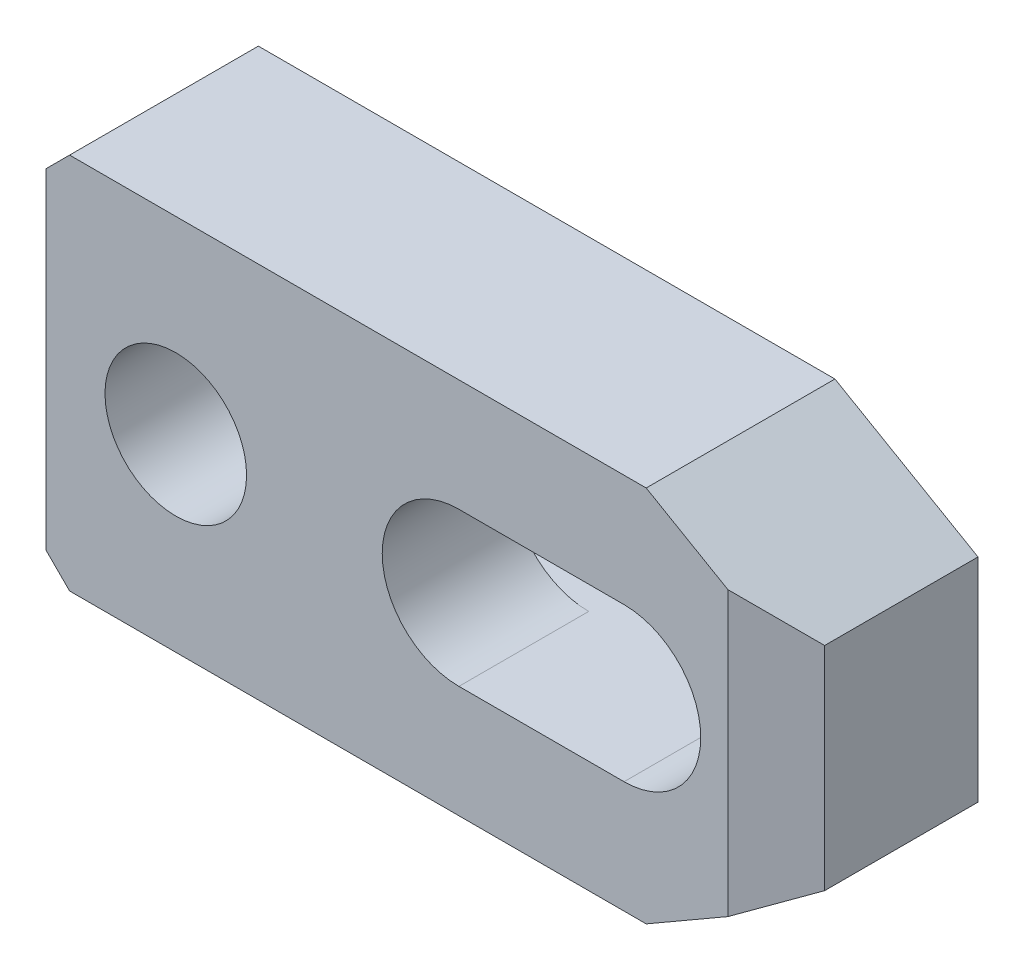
ISO-10303-21;
HEADER;
FILE_DESCRIPTION(('STEP AP214'),'2;1');
FILE_NAME('part.step','',(''),(''),'','','');
FILE_SCHEMA(('AUTOMOTIVE_DESIGN { 1 0 10303 214 1 1 1 1 }'));
ENDSEC;
DATA;
#1=APPLICATION_CONTEXT('core data for automotive mechanical design processes');
#2=APPLICATION_PROTOCOL_DEFINITION('international standard','automotive_design',2000,#1);
#3=PRODUCT_CONTEXT('',#1,'mechanical');
#4=PRODUCT('Part','Part','',(#3));
#5=PRODUCT_RELATED_PRODUCT_CATEGORY('part','',(#4));
#6=PRODUCT_DEFINITION_FORMATION('','',#4);
#7=PRODUCT_DEFINITION_CONTEXT('part definition',#1,'design');
#8=PRODUCT_DEFINITION('design','',#6,#7);
#9=PRODUCT_DEFINITION_SHAPE('','',#8);
#10=(LENGTH_UNIT() NAMED_UNIT(*) SI_UNIT(.MILLI.,.METRE.));
#11=(NAMED_UNIT(*) PLANE_ANGLE_UNIT() SI_UNIT($,.RADIAN.));
#12=(NAMED_UNIT(*) SI_UNIT($,.STERADIAN.) SOLID_ANGLE_UNIT());
#13=UNCERTAINTY_MEASURE_WITH_UNIT(LENGTH_MEASURE(1.E-05),#10,'distance_accuracy_value','');
#14=(GEOMETRIC_REPRESENTATION_CONTEXT(3) GLOBAL_UNCERTAINTY_ASSIGNED_CONTEXT((#13)) GLOBAL_UNIT_ASSIGNED_CONTEXT((#10,
#11,#12)) REPRESENTATION_CONTEXT('',''));
#15=CARTESIAN_POINT('',(0.,0.,0.));
#16=DIRECTION('',(0.,0.,1.));
#17=DIRECTION('',(1.,0.,0.));
#18=AXIS2_PLACEMENT_3D('',#15,#16,#17);
#19=CARTESIAN_POINT('',(-29.110272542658,33.889727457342,0.));
#20=DIRECTION('',(0.,0.,1.));
#21=DIRECTION('',(-1.,0.,0.));
#22=AXIS2_PLACEMENT_3D('',#19,#20,#21);
#23=PLANE('',#22);
#24=DIRECTION('',(0.,1.,0.));
#25=VECTOR('',#24,1.);
#26=CARTESIAN_POINT('',(-49.,-14.,0.));
#27=LINE('',#26,#25);
#28=CARTESIAN_POINT('',(-49.,-14.,0.));
#29=VERTEX_POINT('',#28);
#30=CARTESIAN_POINT('',(-49.,-6.5,0.));
#31=VERTEX_POINT('',#30);
#32=EDGE_CURVE('E147',#29,#31,#27,.T.);
#33=ORIENTED_EDGE('',*,*,#32,.T.);
#34=DIRECTION('',(-1.,0.,0.));
#35=VECTOR('',#34,1.);
#36=CARTESIAN_POINT('',(0.,-6.5,0.));
#37=LINE('',#36,#35);
#38=CARTESIAN_POINT('',(0.,-6.5,0.));
#39=VERTEX_POINT('',#38);
#40=EDGE_CURVE('E237',#39,#31,#37,.T.);
#41=ORIENTED_EDGE('',*,*,#40,.F.);
#42=CARTESIAN_POINT('',(0.,0.,0.));
#43=DIRECTION('',(0.,0.,1.));
#44=DIRECTION('',(-1.,0.,0.));
#45=AXIS2_PLACEMENT_3D('',#42,#43,#44);
#46=CIRCLE('',#45,6.5);
#47=CARTESIAN_POINT('',(0.,6.5,0.));
#48=VERTEX_POINT('',#47);
#49=EDGE_CURVE('E128',#39,#48,#46,.T.);
#50=ORIENTED_EDGE('',*,*,#49,.T.);
#51=DIRECTION('',(1.,0.,0.));
#52=VECTOR('',#51,1.);
#53=CARTESIAN_POINT('',(-14.,6.5,0.));
#54=LINE('',#53,#52);
#55=CARTESIAN_POINT('',(-49.,6.5,0.));
#56=VERTEX_POINT('',#55);
#57=EDGE_CURVE('E119',#56,#48,#54,.T.);
#58=ORIENTED_EDGE('',*,*,#57,.F.);
#59=CARTESIAN_POINT('',(-49.,14.,0.));
#60=VERTEX_POINT('',#59);
#61=EDGE_CURVE('E124',#56,#60,#27,.T.);
#62=ORIENTED_EDGE('',*,*,#61,.T.);
#63=DIRECTION('',(-0.707106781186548,-0.707106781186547,0.));
#64=VECTOR('',#63,1.);
#65=CARTESIAN_POINT('',(-47.,16.,0.));
#66=LINE('',#65,#64);
#67=CARTESIAN_POINT('',(-47.,16.,0.));
#68=VERTEX_POINT('',#67);
#69=EDGE_CURVE('E148',#68,#60,#66,.T.);
#70=ORIENTED_EDGE('',*,*,#69,.F.);
#71=DIRECTION('',(-1.,0.,0.));
#72=VECTOR('',#71,1.);
#73=CARTESIAN_POINT('',(1.87564434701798,16.,0.));
#74=LINE('',#73,#72);
#75=CARTESIAN_POINT('',(1.87564434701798,16.,0.));
#76=VERTEX_POINT('',#75);
#77=EDGE_CURVE('E151',#76,#68,#74,.T.);
#78=ORIENTED_EDGE('',*,*,#77,.F.);
#79=DIRECTION('',(-0.866025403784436,0.5,0.));
#80=VECTOR('',#79,1.);
#81=CARTESIAN_POINT('',(14.,9.,0.));
#82=LINE('',#81,#80);
#83=CARTESIAN_POINT('',(14.,9.,0.));
#84=VERTEX_POINT('',#83);
#85=EDGE_CURVE('E158',#84,#76,#82,.T.);
#86=ORIENTED_EDGE('',*,*,#85,.F.);
#87=DIRECTION('',(0.,-1.,0.));
#88=VECTOR('',#87,1.);
#89=CARTESIAN_POINT('',(14.,9.,0.));
#90=LINE('',#89,#88);
#91=CARTESIAN_POINT('',(14.,-9.,0.));
#92=VERTEX_POINT('',#91);
#93=EDGE_CURVE('E181',#84,#92,#90,.T.);
#94=ORIENTED_EDGE('',*,*,#93,.T.);
#95=DIRECTION('',(-0.86602540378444,-0.5,0.));
#96=VECTOR('',#95,1.);
#97=CARTESIAN_POINT('',(14.,-9.,0.));
#98=LINE('',#97,#96);
#99=CARTESIAN_POINT('',(1.8756443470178,-16.,0.));
#100=VERTEX_POINT('',#99);
#101=EDGE_CURVE('E208',#92,#100,#98,.T.);
#102=ORIENTED_EDGE('',*,*,#101,.T.);
#103=DIRECTION('',(-1.,0.,0.));
#104=VECTOR('',#103,1.);
#105=CARTESIAN_POINT('',(1.8756443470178,-16.,0.));
#106=LINE('',#105,#104);
#107=CARTESIAN_POINT('',(-47.,-16.,0.));
#108=VERTEX_POINT('',#107);
#109=EDGE_CURVE('E210',#100,#108,#106,.T.);
#110=ORIENTED_EDGE('',*,*,#109,.T.);
#111=DIRECTION('',(-0.70710678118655,0.707106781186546,0.));
#112=VECTOR('',#111,1.);
#113=CARTESIAN_POINT('',(-47.,-16.,0.));
#114=LINE('',#113,#112);
#115=EDGE_CURVE('E150',#108,#29,#114,.T.);
#116=ORIENTED_EDGE('',*,*,#115,.T.);
#117=EDGE_LOOP('',(#33,#41,#50,#58,#62,#70,#78,#86,#94,#102,#110,#116));
#118=FACE_BOUND('',#117,.T.);
#119=ADVANCED_FACE('F14',(#118),#23,.F.);
#120=CARTESIAN_POINT('',(-49.,-14.,16.));
#121=DIRECTION('',(-1.,0.,0.));
#122=DIRECTION('',(0.,0.,-1.));
#123=AXIS2_PLACEMENT_3D('',#120,#121,#122);
#124=PLANE('',#123);
#125=DIRECTION('',(0.,-1.,0.));
#126=VECTOR('',#125,1.);
#127=CARTESIAN_POINT('',(-49.,-14.,5.));
#128=LINE('',#127,#126);
#129=CARTESIAN_POINT('',(-49.,6.5,5.));
#130=VERTEX_POINT('',#129);
#131=CARTESIAN_POINT('',(-49.,-6.5,5.));
#132=VERTEX_POINT('',#131);
#133=EDGE_CURVE('E141',#130,#132,#128,.T.);
#134=ORIENTED_EDGE('',*,*,#133,.T.);
#135=DIRECTION('',(0.,0.,-1.));
#136=VECTOR('',#135,1.);
#137=CARTESIAN_POINT('',(-49.,-6.5,16.));
#138=LINE('',#137,#136);
#139=EDGE_CURVE('E140',#132,#31,#138,.T.);
#140=ORIENTED_EDGE('',*,*,#139,.T.);
#141=ORIENTED_EDGE('',*,*,#32,.F.);
#142=DIRECTION('',(0.,0.,-1.));
#143=VECTOR('',#142,1.);
#144=CARTESIAN_POINT('',(-49.,-14.,16.));
#145=LINE('',#144,#143);
#146=CARTESIAN_POINT('',(-49.,-14.,16.));
#147=VERTEX_POINT('',#146);
#148=EDGE_CURVE('E189',#147,#29,#145,.T.);
#149=ORIENTED_EDGE('',*,*,#148,.F.);
#150=DIRECTION('',(0.,1.,0.));
#151=VECTOR('',#150,1.);
#152=CARTESIAN_POINT('',(-49.,-14.,16.));
#153=LINE('',#152,#151);
#154=CARTESIAN_POINT('',(-49.,14.,16.));
#155=VERTEX_POINT('',#154);
#156=EDGE_CURVE('E171',#147,#155,#153,.T.);
#157=ORIENTED_EDGE('',*,*,#156,.T.);
#158=DIRECTION('',(0.,0.,-1.));
#159=VECTOR('',#158,1.);
#160=CARTESIAN_POINT('',(-49.,14.,16.));
#161=LINE('',#160,#159);
#162=EDGE_CURVE('E145',#155,#60,#161,.T.);
#163=ORIENTED_EDGE('',*,*,#162,.T.);
#164=ORIENTED_EDGE('',*,*,#61,.F.);
#165=DIRECTION('',(0.,0.,-1.));
#166=VECTOR('',#165,1.);
#167=CARTESIAN_POINT('',(-49.,6.5,16.));
#168=LINE('',#167,#166);
#169=EDGE_CURVE('E135',#130,#56,#168,.T.);
#170=ORIENTED_EDGE('',*,*,#169,.F.);
#171=EDGE_LOOP('',(#134,#140,#141,#149,#157,#163,#164,#170));
#172=FACE_BOUND('',#171,.T.);
#173=ADVANCED_FACE('F143',(#172),#124,.T.);
#174=CARTESIAN_POINT('',(-38.,0.,16.));
#175=DIRECTION('',(0.,0.,-1.));
#176=DIRECTION('',(1.,0.,0.));
#177=AXIS2_PLACEMENT_3D('',#174,#175,#176);
#178=CYLINDRICAL_SURFACE('',#177,6.);
#179=CARTESIAN_POINT('',(-38.,0.,16.));
#180=DIRECTION('',(0.,0.,1.));
#181=DIRECTION('',(-1.,0.,0.));
#182=AXIS2_PLACEMENT_3D('',#179,#180,#181);
#183=CIRCLE('',#182,6.);
#184=CARTESIAN_POINT('',(-44.,0.,16.));
#185=VERTEX_POINT('',#184);
#186=EDGE_CURVE('E161',#185,#185,#183,.T.);
#187=ORIENTED_EDGE('',*,*,#186,.T.);
#188=EDGE_LOOP('',(#187));
#189=FACE_BOUND('',#188,.T.);
#190=CARTESIAN_POINT('',(-38.,0.,5.));
#191=DIRECTION('',(0.,0.,-1.));
#192=DIRECTION('',(1.,0.,0.));
#193=AXIS2_PLACEMENT_3D('',#190,#191,#192);
#194=CIRCLE('',#193,6.);
#195=CARTESIAN_POINT('',(-32.,0.,5.));
#196=VERTEX_POINT('',#195);
#197=EDGE_CURVE('E425',#196,#196,#194,.T.);
#198=ORIENTED_EDGE('',*,*,#197,.T.);
#199=EDGE_LOOP('',(#198));
#200=FACE_BOUND('',#199,.T.);
#201=ADVANCED_FACE('F262',(#189,#200),#178,.F.);
#202=CARTESIAN_POINT('',(-14.,0.,16.));
#203=DIRECTION('',(0.,0.,-1.));
#204=DIRECTION('',(1.,0.,0.));
#205=AXIS2_PLACEMENT_3D('',#202,#203,#204);
#206=CYLINDRICAL_SURFACE('',#205,6.5);
#207=DIRECTION('',(0.,0.,-1.));
#208=VECTOR('',#207,1.);
#209=CARTESIAN_POINT('',(-14.,-6.5,16.));
#210=LINE('',#209,#208);
#211=CARTESIAN_POINT('',(-14.,-6.5,16.));
#212=VERTEX_POINT('',#211);
#213=CARTESIAN_POINT('',(-14.,-6.5,5.));
#214=VERTEX_POINT('',#213);
#215=EDGE_CURVE('E256',#212,#214,#210,.T.);
#216=ORIENTED_EDGE('',*,*,#215,.T.);
#217=CARTESIAN_POINT('',(-14.,0.,5.));
#218=DIRECTION('',(0.,0.,-1.));
#219=DIRECTION('',(1.,0.,0.));
#220=AXIS2_PLACEMENT_3D('',#217,#218,#219);
#221=CIRCLE('',#220,6.5);
#222=CARTESIAN_POINT('',(-14.,6.5,5.));
#223=VERTEX_POINT('',#222);
#224=EDGE_CURVE('E278',#214,#223,#221,.T.);
#225=ORIENTED_EDGE('',*,*,#224,.T.);
#226=DIRECTION('',(0.,0.,-1.));
#227=VECTOR('',#226,1.);
#228=CARTESIAN_POINT('',(-14.,6.5,16.));
#229=LINE('',#228,#227);
#230=CARTESIAN_POINT('',(-14.,6.5,16.));
#231=VERTEX_POINT('',#230);
#232=EDGE_CURVE('E244',#231,#223,#229,.T.);
#233=ORIENTED_EDGE('',*,*,#232,.F.);
#234=CARTESIAN_POINT('',(-14.,0.,16.));
#235=DIRECTION('',(0.,0.,1.));
#236=DIRECTION('',(-1.,0.,0.));
#237=AXIS2_PLACEMENT_3D('',#234,#235,#236);
#238=CIRCLE('',#237,6.5);
#239=EDGE_CURVE('E132',#231,#212,#238,.T.);
#240=ORIENTED_EDGE('',*,*,#239,.T.);
#241=EDGE_LOOP('',(#216,#225,#233,#240));
#242=FACE_BOUND('',#241,.T.);
#243=ADVANCED_FACE('F269',(#242),#206,.F.);
#244=CARTESIAN_POINT('',(-29.110272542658,33.889727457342,16.));
#245=DIRECTION('',(0.,0.,1.));
#246=DIRECTION('',(-1.,0.,0.));
#247=AXIS2_PLACEMENT_3D('',#244,#245,#246);
#248=PLANE('',#247);
#249=DIRECTION('',(0.,-1.,0.));
#250=VECTOR('',#249,1.);
#251=CARTESIAN_POINT('',(8.80384757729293,33.889727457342,16.));
#252=LINE('',#251,#250);
#253=CARTESIAN_POINT('',(8.80384757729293,12.0000000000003,16.));
#254=VERTEX_POINT('',#253);
#255=CARTESIAN_POINT('',(8.80384757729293,-12.0000000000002,16.));
#256=VERTEX_POINT('',#255);
#257=EDGE_CURVE('E233',#254,#256,#252,.T.);
#258=ORIENTED_EDGE('',*,*,#257,.F.);
#259=DIRECTION('',(-0.866025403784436,0.5,0.));
#260=VECTOR('',#259,1.);
#261=CARTESIAN_POINT('',(14.,9.,16.));
#262=LINE('',#261,#260);
#263=CARTESIAN_POINT('',(1.87564434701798,16.,16.));
#264=VERTEX_POINT('',#263);
#265=EDGE_CURVE('E179',#254,#264,#262,.T.);
#266=ORIENTED_EDGE('',*,*,#265,.T.);
#267=DIRECTION('',(-1.,0.,0.));
#268=VECTOR('',#267,1.);
#269=CARTESIAN_POINT('',(1.87564434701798,16.,16.));
#270=LINE('',#269,#268);
#271=CARTESIAN_POINT('',(-47.,16.,16.));
#272=VERTEX_POINT('',#271);
#273=EDGE_CURVE('E176',#264,#272,#270,.T.);
#274=ORIENTED_EDGE('',*,*,#273,.T.);
#275=DIRECTION('',(-0.707106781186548,-0.707106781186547,0.));
#276=VECTOR('',#275,1.);
#277=CARTESIAN_POINT('',(-47.,16.,16.));
#278=LINE('',#277,#276);
#279=EDGE_CURVE('E173',#272,#155,#278,.T.);
#280=ORIENTED_EDGE('',*,*,#279,.T.);
#281=ORIENTED_EDGE('',*,*,#156,.F.);
#282=DIRECTION('',(-0.70710678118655,0.707106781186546,0.));
#283=VECTOR('',#282,1.);
#284=CARTESIAN_POINT('',(-47.,-16.,16.));
#285=LINE('',#284,#283);
#286=CARTESIAN_POINT('',(-47.,-16.,16.));
#287=VERTEX_POINT('',#286);
#288=EDGE_CURVE('E168',#287,#147,#285,.T.);
#289=ORIENTED_EDGE('',*,*,#288,.F.);
#290=DIRECTION('',(-1.,0.,0.));
#291=VECTOR('',#290,1.);
#292=CARTESIAN_POINT('',(1.8756443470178,-16.,16.));
#293=LINE('',#292,#291);
#294=CARTESIAN_POINT('',(1.8756443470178,-16.,16.));
#295=VERTEX_POINT('',#294);
#296=EDGE_CURVE('E165',#295,#287,#293,.T.);
#297=ORIENTED_EDGE('',*,*,#296,.F.);
#298=DIRECTION('',(-0.86602540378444,-0.5,0.));
#299=VECTOR('',#298,1.);
#300=CARTESIAN_POINT('',(14.,-9.,16.));
#301=LINE('',#300,#299);
#302=EDGE_CURVE('E162',#256,#295,#301,.T.);
#303=ORIENTED_EDGE('',*,*,#302,.F.);
#304=EDGE_LOOP('',(#258,#266,#274,#280,#281,#289,#297,#303));
#305=FACE_BOUND('',#304,.T.);
#306=ORIENTED_EDGE('',*,*,#186,.F.);
#307=EDGE_LOOP('',(#306));
#308=FACE_BOUND('',#307,.T.);
#309=DIRECTION('',(-1.,0.,0.));
#310=VECTOR('',#309,1.);
#311=CARTESIAN_POINT('',(0.,-6.5,16.));
#312=LINE('',#311,#310);
#313=CARTESIAN_POINT('',(0.,-6.5,16.));
#314=VERTEX_POINT('',#313);
#315=EDGE_CURVE('E247',#314,#212,#312,.T.);
#316=ORIENTED_EDGE('',*,*,#315,.T.);
#317=ORIENTED_EDGE('',*,*,#239,.F.);
#318=DIRECTION('',(1.,0.,0.));
#319=VECTOR('',#318,1.);
#320=CARTESIAN_POINT('',(-14.,6.5,16.));
#321=LINE('',#320,#319);
#322=CARTESIAN_POINT('',(0.,6.5,16.));
#323=VERTEX_POINT('',#322);
#324=EDGE_CURVE('E241',#231,#323,#321,.T.);
#325=ORIENTED_EDGE('',*,*,#324,.T.);
#326=CARTESIAN_POINT('',(0.,0.,16.));
#327=DIRECTION('',(0.,0.,1.));
#328=DIRECTION('',(-1.,0.,0.));
#329=AXIS2_PLACEMENT_3D('',#326,#327,#328);
#330=CIRCLE('',#329,6.5);
#331=EDGE_CURVE('E245',#314,#323,#330,.T.);
#332=ORIENTED_EDGE('',*,*,#331,.F.);
#333=EDGE_LOOP('',(#316,#317,#325,#332));
#334=FACE_BOUND('',#333,.T.);
#335=ADVANCED_FACE('F265',(#305,#308,#334),#248,.T.);
#336=CARTESIAN_POINT('',(14.,9.,16.));
#337=DIRECTION('',(-0.5,-0.866025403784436,0.));
#338=DIRECTION('',(0.866025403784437,-0.5,0.));
#339=AXIS2_PLACEMENT_3D('',#336,#337,#338);
#340=PLANE('',#339);
#341=ORIENTED_EDGE('',*,*,#265,.F.);
#342=DIRECTION('',(0.774596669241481,-0.447213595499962,-0.447213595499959));
#343=VECTOR('',#342,1.);
#344=CARTESIAN_POINT('',(12.9607695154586,9.6,13.5999999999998));
#345=LINE('',#344,#343);
#346=CARTESIAN_POINT('',(13.9999999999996,9.,13.));
#347=VERTEX_POINT('',#346);
#348=EDGE_CURVE('E235',#254,#347,#345,.T.);
#349=ORIENTED_EDGE('',*,*,#348,.T.);
#350=DIRECTION('',(0.,0.,-1.));
#351=VECTOR('',#350,1.);
#352=CARTESIAN_POINT('',(14.,9.,16.));
#353=LINE('',#352,#351);
#354=EDGE_CURVE('E164',#347,#84,#353,.T.);
#355=ORIENTED_EDGE('',*,*,#354,.T.);
#356=ORIENTED_EDGE('',*,*,#85,.T.);
#357=DIRECTION('',(0.,0.,-1.));
#358=VECTOR('',#357,1.);
#359=CARTESIAN_POINT('',(1.87564434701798,16.,16.));
#360=LINE('',#359,#358);
#361=EDGE_CURVE('E9',#264,#76,#360,.T.);
#362=ORIENTED_EDGE('',*,*,#361,.F.);
#363=EDGE_LOOP('',(#341,#349,#355,#356,#362));
#364=FACE_BOUND('',#363,.T.);
#365=ADVANCED_FACE('F268',(#364),#340,.F.);
#366=CARTESIAN_POINT('',(1.87564434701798,16.,16.));
#367=DIRECTION('',(0.,-1.,0.));
#368=DIRECTION('',(0.,0.,1.));
#369=AXIS2_PLACEMENT_3D('',#366,#367,#368);
#370=PLANE('',#369);
#371=DIRECTION('',(0.,0.,-1.));
#372=VECTOR('',#371,1.);
#373=CARTESIAN_POINT('',(-47.,16.,16.));
#374=LINE('',#373,#372);
#375=EDGE_CURVE('E22',#272,#68,#374,.T.);
#376=ORIENTED_EDGE('',*,*,#375,.F.);
#377=ORIENTED_EDGE('',*,*,#273,.F.);
#378=ORIENTED_EDGE('',*,*,#361,.T.);
#379=ORIENTED_EDGE('',*,*,#77,.T.);
#380=EDGE_LOOP('',(#376,#377,#378,#379));
#381=FACE_BOUND('',#380,.T.);
#382=ADVANCED_FACE('F16',(#381),#370,.F.);
#383=CARTESIAN_POINT('',(-47.,16.,16.));
#384=DIRECTION('',(0.707106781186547,-0.707106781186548,0.));
#385=DIRECTION('',(0.707106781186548,0.707106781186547,0.));
#386=AXIS2_PLACEMENT_3D('',#383,#384,#385);
#387=PLANE('',#386);
#388=ORIENTED_EDGE('',*,*,#162,.F.);
#389=ORIENTED_EDGE('',*,*,#279,.F.);
#390=ORIENTED_EDGE('',*,*,#375,.T.);
#391=ORIENTED_EDGE('',*,*,#69,.T.);
#392=EDGE_LOOP('',(#388,#389,#390,#391));
#393=FACE_BOUND('',#392,.T.);
#394=ADVANCED_FACE('F193',(#393),#387,.F.);
#395=CARTESIAN_POINT('',(-47.,-16.,16.));
#396=DIRECTION('',(-0.707106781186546,-0.70710678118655,0.));
#397=DIRECTION('',(0.70710678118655,-0.707106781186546,0.));
#398=AXIS2_PLACEMENT_3D('',#395,#396,#397);
#399=PLANE('',#398);
#400=DIRECTION('',(0.,0.,-1.));
#401=VECTOR('',#400,1.);
#402=CARTESIAN_POINT('',(-47.,-16.,16.));
#403=LINE('',#402,#401);
#404=EDGE_CURVE('E187',#287,#108,#403,.T.);
#405=ORIENTED_EDGE('',*,*,#404,.F.);
#406=ORIENTED_EDGE('',*,*,#288,.T.);
#407=ORIENTED_EDGE('',*,*,#148,.T.);
#408=ORIENTED_EDGE('',*,*,#115,.F.);
#409=EDGE_LOOP('',(#405,#406,#407,#408));
#410=FACE_BOUND('',#409,.T.);
#411=ADVANCED_FACE('F220',(#410),#399,.T.);
#412=CARTESIAN_POINT('',(1.8756443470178,-16.,16.));
#413=DIRECTION('',(0.,-1.,0.));
#414=DIRECTION('',(0.,0.,1.));
#415=AXIS2_PLACEMENT_3D('',#412,#413,#414);
#416=PLANE('',#415);
#417=DIRECTION('',(0.,0.,-1.));
#418=VECTOR('',#417,1.);
#419=CARTESIAN_POINT('',(1.8756443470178,-16.,16.));
#420=LINE('',#419,#418);
#421=EDGE_CURVE('E185',#295,#100,#420,.T.);
#422=ORIENTED_EDGE('',*,*,#421,.F.);
#423=ORIENTED_EDGE('',*,*,#296,.T.);
#424=ORIENTED_EDGE('',*,*,#404,.T.);
#425=ORIENTED_EDGE('',*,*,#109,.F.);
#426=EDGE_LOOP('',(#422,#423,#424,#425));
#427=FACE_BOUND('',#426,.T.);
#428=ADVANCED_FACE('F306',(#427),#416,.T.);
#429=CARTESIAN_POINT('',(14.,-9.,16.));
#430=DIRECTION('',(0.5,-0.86602540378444,0.));
#431=DIRECTION('',(0.86602540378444,0.5,0.));
#432=AXIS2_PLACEMENT_3D('',#429,#430,#431);
#433=PLANE('',#432);
#434=DIRECTION('',(0.774596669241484,0.447213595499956,-0.44721359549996));
#435=VECTOR('',#434,1.);
#436=CARTESIAN_POINT('',(12.9607695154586,-9.6,13.5999999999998));
#437=LINE('',#436,#435);
#438=CARTESIAN_POINT('',(14.,-9.,12.9999999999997));
#439=VERTEX_POINT('',#438);
#440=EDGE_CURVE('E37',#256,#439,#437,.T.);
#441=ORIENTED_EDGE('',*,*,#440,.F.);
#442=ORIENTED_EDGE('',*,*,#302,.T.);
#443=ORIENTED_EDGE('',*,*,#421,.T.);
#444=ORIENTED_EDGE('',*,*,#101,.F.);
#445=DIRECTION('',(0.,0.,-1.));
#446=VECTOR('',#445,1.);
#447=CARTESIAN_POINT('',(14.,-9.,16.));
#448=LINE('',#447,#446);
#449=EDGE_CURVE('E183',#439,#92,#448,.T.);
#450=ORIENTED_EDGE('',*,*,#449,.F.);
#451=EDGE_LOOP('',(#441,#442,#443,#444,#450));
#452=FACE_BOUND('',#451,.T.);
#453=ADVANCED_FACE('F303',(#452),#433,.T.);
#454=CARTESIAN_POINT('',(14.,9.,16.));
#455=DIRECTION('',(1.,0.,0.));
#456=DIRECTION('',(0.,0.,1.));
#457=AXIS2_PLACEMENT_3D('',#454,#455,#456);
#458=PLANE('',#457);
#459=DIRECTION('',(0.,-1.,0.));
#460=VECTOR('',#459,1.);
#461=CARTESIAN_POINT('',(13.9999999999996,20.,13.));
#462=LINE('',#461,#460);
#463=EDGE_CURVE('E227',#347,#439,#462,.T.);
#464=ORIENTED_EDGE('',*,*,#463,.T.);
#465=ORIENTED_EDGE('',*,*,#449,.T.);
#466=ORIENTED_EDGE('',*,*,#93,.F.);
#467=ORIENTED_EDGE('',*,*,#354,.F.);
#468=EDGE_LOOP('',(#464,#465,#466,#467));
#469=FACE_BOUND('',#468,.T.);
#470=ADVANCED_FACE('F205',(#469),#458,.T.);
#471=CARTESIAN_POINT('',(0.,-6.5,16.));
#472=DIRECTION('',(0.,-1.,0.));
#473=DIRECTION('',(1.,0.,0.));
#474=AXIS2_PLACEMENT_3D('',#471,#472,#473);
#475=PLANE('',#474);
#476=ORIENTED_EDGE('',*,*,#40,.T.);
#477=ORIENTED_EDGE('',*,*,#139,.F.);
#478=DIRECTION('',(1.,0.,0.));
#479=VECTOR('',#478,1.);
#480=CARTESIAN_POINT('',(-56.,-6.5,5.));
#481=LINE('',#480,#479);
#482=EDGE_CURVE('E276',#132,#214,#481,.T.);
#483=ORIENTED_EDGE('',*,*,#482,.T.);
#484=ORIENTED_EDGE('',*,*,#215,.F.);
#485=ORIENTED_EDGE('',*,*,#315,.F.);
#486=DIRECTION('',(0.,0.,-1.));
#487=VECTOR('',#486,1.);
#488=CARTESIAN_POINT('',(0.,-6.5,16.));
#489=LINE('',#488,#487);
#490=EDGE_CURVE('E255',#314,#39,#489,.T.);
#491=ORIENTED_EDGE('',*,*,#490,.T.);
#492=EDGE_LOOP('',(#476,#477,#483,#484,#485,#491));
#493=FACE_BOUND('',#492,.T.);
#494=ADVANCED_FACE('F275',(#493),#475,.F.);
#495=CARTESIAN_POINT('',(0.,0.,16.));
#496=DIRECTION('',(0.,0.,-1.));
#497=DIRECTION('',(1.,0.,0.));
#498=AXIS2_PLACEMENT_3D('',#495,#496,#497);
#499=CYLINDRICAL_SURFACE('',#498,6.5);
#500=DIRECTION('',(0.,0.,-1.));
#501=VECTOR('',#500,1.);
#502=CARTESIAN_POINT('',(0.,6.5,16.));
#503=LINE('',#502,#501);
#504=EDGE_CURVE('E253',#323,#48,#503,.T.);
#505=ORIENTED_EDGE('',*,*,#504,.T.);
#506=ORIENTED_EDGE('',*,*,#49,.F.);
#507=ORIENTED_EDGE('',*,*,#490,.F.);
#508=ORIENTED_EDGE('',*,*,#331,.T.);
#509=EDGE_LOOP('',(#505,#506,#507,#508));
#510=FACE_BOUND('',#509,.T.);
#511=ADVANCED_FACE('F280',(#510),#499,.F.);
#512=CARTESIAN_POINT('',(-14.,6.5,16.));
#513=DIRECTION('',(0.,1.,0.));
#514=DIRECTION('',(-1.,0.,0.));
#515=AXIS2_PLACEMENT_3D('',#512,#513,#514);
#516=PLANE('',#515);
#517=ORIENTED_EDGE('',*,*,#57,.T.);
#518=ORIENTED_EDGE('',*,*,#504,.F.);
#519=ORIENTED_EDGE('',*,*,#324,.F.);
#520=ORIENTED_EDGE('',*,*,#232,.T.);
#521=DIRECTION('',(1.,0.,0.));
#522=VECTOR('',#521,1.);
#523=CARTESIAN_POINT('',(-56.,6.5,5.));
#524=LINE('',#523,#522);
#525=EDGE_CURVE('E29',#130,#223,#524,.T.);
#526=ORIENTED_EDGE('',*,*,#525,.F.);
#527=ORIENTED_EDGE('',*,*,#169,.T.);
#528=EDGE_LOOP('',(#517,#518,#519,#520,#526,#527));
#529=FACE_BOUND('',#528,.T.);
#530=ADVANCED_FACE('F136',(#529),#516,.F.);
#531=CARTESIAN_POINT('',(1.87564434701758,20.,20.));
#532=DIRECTION('',(-0.5,0.,-0.866025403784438));
#533=DIRECTION('',(0.866025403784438,0.,-0.5));
#534=AXIS2_PLACEMENT_3D('',#531,#532,#533);
#535=PLANE('',#534);
#536=ORIENTED_EDGE('',*,*,#257,.T.);
#537=ORIENTED_EDGE('',*,*,#440,.T.);
#538=ORIENTED_EDGE('',*,*,#463,.F.);
#539=ORIENTED_EDGE('',*,*,#348,.F.);
#540=EDGE_LOOP('',(#536,#537,#538,#539));
#541=FACE_BOUND('',#540,.T.);
#542=ADVANCED_FACE('F288',(#541),#535,.F.);
#543=CARTESIAN_POINT('',(-56.,-6.5,5.));
#544=DIRECTION('',(0.,0.,-1.));
#545=DIRECTION('',(1.,0.,0.));
#546=AXIS2_PLACEMENT_3D('',#543,#544,#545);
#547=PLANE('',#546);
#548=ORIENTED_EDGE('',*,*,#197,.F.);
#549=EDGE_LOOP('',(#548));
#550=FACE_BOUND('',#549,.T.);
#551=ORIENTED_EDGE('',*,*,#525,.T.);
#552=ORIENTED_EDGE('',*,*,#224,.F.);
#553=ORIENTED_EDGE('',*,*,#482,.F.);
#554=ORIENTED_EDGE('',*,*,#133,.F.);
#555=EDGE_LOOP('',(#551,#552,#553,#554));
#556=FACE_BOUND('',#555,.T.);
#557=ADVANCED_FACE('F410',(#550,#556),#547,.T.);
#558=CLOSED_SHELL('',(#119,#173,#201,#243,#335,#365,#382,#394,#411,#428,#453,#470,#494,#511,
#530,#542,#557));
#559=MANIFOLD_SOLID_BREP('B1',#558);
#560=ADVANCED_BREP_SHAPE_REPRESENTATION('',(#18,#559),#14);
#561=SHAPE_DEFINITION_REPRESENTATION(#9,#560);
ENDSEC;
END-ISO-10303-21;
